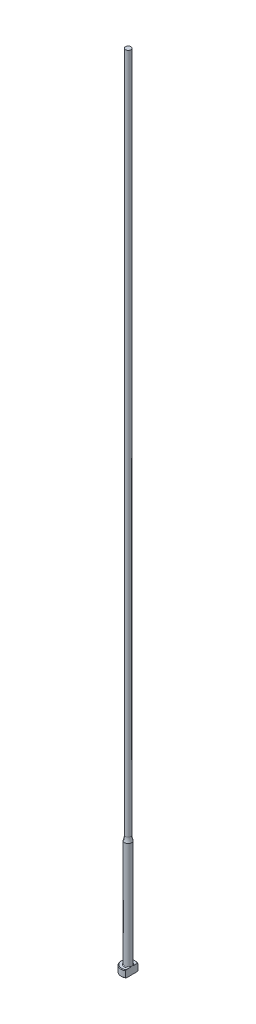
ISO-10303-21;
HEADER;
FILE_DESCRIPTION(('STEP AP214'),'2;1');
FILE_NAME('part.step','',(''),(''),'','','');
FILE_SCHEMA(('AUTOMOTIVE_DESIGN { 1 0 10303 214 1 1 1 1 }'));
ENDSEC;
DATA;
#1=APPLICATION_CONTEXT('core data for automotive mechanical design processes');
#2=APPLICATION_PROTOCOL_DEFINITION('international standard','automotive_design',2000,#1);
#3=PRODUCT_CONTEXT('',#1,'mechanical');
#4=PRODUCT('Part','Part','',(#3));
#5=PRODUCT_RELATED_PRODUCT_CATEGORY('part','',(#4));
#6=PRODUCT_DEFINITION_FORMATION('','',#4);
#7=PRODUCT_DEFINITION_CONTEXT('part definition',#1,'design');
#8=PRODUCT_DEFINITION('design','',#6,#7);
#9=PRODUCT_DEFINITION_SHAPE('','',#8);
#10=(LENGTH_UNIT() NAMED_UNIT(*) SI_UNIT(.MILLI.,.METRE.));
#11=(NAMED_UNIT(*) PLANE_ANGLE_UNIT() SI_UNIT($,.RADIAN.));
#12=(NAMED_UNIT(*) SI_UNIT($,.STERADIAN.) SOLID_ANGLE_UNIT());
#13=UNCERTAINTY_MEASURE_WITH_UNIT(LENGTH_MEASURE(1.E-05),#10,'distance_accuracy_value','');
#14=(GEOMETRIC_REPRESENTATION_CONTEXT(3) GLOBAL_UNCERTAINTY_ASSIGNED_CONTEXT((#13)) GLOBAL_UNIT_ASSIGNED_CONTEXT((#10,
#11,#12)) REPRESENTATION_CONTEXT('',''));
#15=CARTESIAN_POINT('',(0.,0.,0.));
#16=DIRECTION('',(0.,0.,1.));
#17=DIRECTION('',(1.,0.,0.));
#18=AXIS2_PLACEMENT_3D('',#15,#16,#17);
#19=CARTESIAN_POINT('',(-3.17499999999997,3.175,0.));
#20=DIRECTION('',(0.,1.,0.));
#21=DIRECTION('',(0.,0.,1.));
#22=AXIS2_PLACEMENT_3D('',#19,#20,#21);
#23=PLANE('',#22);
#24=CARTESIAN_POINT('',(0.,3.175,0.));
#25=DIRECTION('',(0.,1.,0.));
#26=DIRECTION('',(0.,0.,1.));
#27=AXIS2_PLACEMENT_3D('',#24,#25,#26);
#28=CIRCLE('',#27,2.92099999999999);
#29=CARTESIAN_POINT('',(1.58749999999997,3.175,-2.4519552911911));
#30=VERTEX_POINT('',#29);
#31=CARTESIAN_POINT('',(1.58749999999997,3.175,2.4519552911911));
#32=VERTEX_POINT('',#31);
#33=EDGE_CURVE('E105',#30,#32,#28,.T.);
#34=ORIENTED_EDGE('',*,*,#33,.T.);
#35=DIRECTION('',(0.,0.,1.));
#36=VECTOR('',#35,1.);
#37=CARTESIAN_POINT('',(1.58749999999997,3.17499999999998,2.74963065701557));
#38=LINE('',#37,#36);
#39=CARTESIAN_POINT('',(1.58749999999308,3.175,0.933255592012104));
#40=VERTEX_POINT('',#39);
#41=EDGE_CURVE('E126',#40,#32,#38,.T.);
#42=ORIENTED_EDGE('',*,*,#41,.F.);
#43=CARTESIAN_POINT('',(0.,3.175,0.));
#44=DIRECTION('',(0.,1.,0.));
#45=DIRECTION('',(0.,0.,1.));
#46=AXIS2_PLACEMENT_3D('',#43,#44,#45);
#47=CIRCLE('',#46,1.84149999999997);
#48=CARTESIAN_POINT('',(1.58749999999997,3.17500000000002,-0.933255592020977));
#49=VERTEX_POINT('',#48);
#50=EDGE_CURVE('E11',#40,#49,#47,.F.);
#51=ORIENTED_EDGE('',*,*,#50,.T.);
#52=EDGE_CURVE('E52',#30,#49,#38,.T.);
#53=ORIENTED_EDGE('',*,*,#52,.F.);
#54=EDGE_LOOP('',(#34,#42,#51,#53));
#55=FACE_BOUND('',#54,.T.);
#56=ADVANCED_FACE('F32',(#55),#23,.T.);
#57=CARTESIAN_POINT('',(0.,259.958771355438,0.));
#58=DIRECTION('',(0.,1.,0.));
#59=DIRECTION('',(0.,0.,1.));
#60=AXIS2_PLACEMENT_3D('',#57,#58,#59);
#61=CYLINDRICAL_SURFACE('',#60,3.17499999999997);
#62=CARTESIAN_POINT('',(0.,2.92100000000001,0.));
#63=DIRECTION('',(0.,1.,0.));
#64=DIRECTION('',(0.,0.,1.));
#65=AXIS2_PLACEMENT_3D('',#62,#63,#64);
#66=CIRCLE('',#65,3.17499999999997);
#67=CARTESIAN_POINT('',(1.58749999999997,2.92100000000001,2.74963065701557));
#68=VERTEX_POINT('',#67);
#69=CARTESIAN_POINT('',(1.58749999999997,2.92100000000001,-2.74963065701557));
#70=VERTEX_POINT('',#69);
#71=EDGE_CURVE('E98',#68,#70,#66,.F.);
#72=ORIENTED_EDGE('',*,*,#71,.T.);
#73=DIRECTION('',(0.,-1.,0.));
#74=VECTOR('',#73,1.);
#75=CARTESIAN_POINT('',(1.58749999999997,355.601,-2.74963065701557));
#76=LINE('',#75,#74);
#77=CARTESIAN_POINT('',(1.58749999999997,0.253999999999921,-2.74963065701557));
#78=VERTEX_POINT('',#77);
#79=EDGE_CURVE('E141',#70,#78,#76,.T.);
#80=ORIENTED_EDGE('',*,*,#79,.T.);
#81=CARTESIAN_POINT('',(0.,0.253999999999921,0.));
#82=DIRECTION('',(0.,-1.,0.));
#83=DIRECTION('',(0.,0.,-1.));
#84=AXIS2_PLACEMENT_3D('',#81,#82,#83);
#85=CIRCLE('',#84,3.17499999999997);
#86=CARTESIAN_POINT('',(1.58749999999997,0.253999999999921,2.74963065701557));
#87=VERTEX_POINT('',#86);
#88=EDGE_CURVE('E95',#78,#87,#85,.F.);
#89=ORIENTED_EDGE('',*,*,#88,.T.);
#90=DIRECTION('',(0.,-1.,0.));
#91=VECTOR('',#90,1.);
#92=CARTESIAN_POINT('',(1.58749999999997,355.601,2.74963065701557));
#93=LINE('',#92,#91);
#94=EDGE_CURVE('E88',#68,#87,#93,.T.);
#95=ORIENTED_EDGE('',*,*,#94,.F.);
#96=EDGE_LOOP('',(#72,#80,#89,#95));
#97=FACE_BOUND('',#96,.T.);
#98=ADVANCED_FACE('F191',(#97),#61,.T.);
#99=CARTESIAN_POINT('',(0.,0.,0.));
#100=DIRECTION('',(0.,-1.,0.));
#101=DIRECTION('',(0.,0.,-1.));
#102=AXIS2_PLACEMENT_3D('',#99,#100,#101);
#103=PLANE('',#102);
#104=CARTESIAN_POINT('',(0.,0.,0.));
#105=DIRECTION('',(0.,-1.,0.));
#106=DIRECTION('',(0.,0.,-1.));
#107=AXIS2_PLACEMENT_3D('',#104,#105,#106);
#108=CIRCLE('',#107,2.92100000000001);
#109=CARTESIAN_POINT('',(1.58749999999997,0.,2.45195529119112));
#110=VERTEX_POINT('',#109);
#111=CARTESIAN_POINT('',(1.58749999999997,0.,-2.45195529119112));
#112=VERTEX_POINT('',#111);
#113=EDGE_CURVE('E93',#110,#112,#108,.T.);
#114=ORIENTED_EDGE('',*,*,#113,.T.);
#115=DIRECTION('',(0.,0.,1.));
#116=VECTOR('',#115,1.);
#117=CARTESIAN_POINT('',(1.58749999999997,0.,2.74963065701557));
#118=LINE('',#117,#116);
#119=EDGE_CURVE('E78',#112,#110,#118,.T.);
#120=ORIENTED_EDGE('',*,*,#119,.T.);
#121=EDGE_LOOP('',(#114,#120));
#122=FACE_BOUND('',#121,.T.);
#123=ADVANCED_FACE('F97',(#122),#103,.T.);
#124=CARTESIAN_POINT('',(0.,3.17499999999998,0.));
#125=DIRECTION('',(0.,-1.,0.));
#126=DIRECTION('',(0.,0.,-1.));
#127=AXIS2_PLACEMENT_3D('',#124,#125,#126);
#128=CONICAL_SURFACE('',#127,2.92100000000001,0.785398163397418);
#129=ORIENTED_EDGE('',*,*,#71,.F.);
#130=CARTESIAN_POINT('',(1.58749999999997,-0.161620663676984,-6.0529050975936));
#131=CARTESIAN_POINT('',(1.58749999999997,-0.0288893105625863,-5.91567682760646));
#132=CARTESIAN_POINT('',(1.58749999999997,0.103699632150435,-5.77831035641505));
#133=CARTESIAN_POINT('',(1.58749999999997,0.368508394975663,-5.50321874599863));
#134=CARTESIAN_POINT('',(1.58749999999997,0.5007282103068,-5.3654936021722));
#135=CARTESIAN_POINT('',(1.58749999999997,0.764778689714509,-5.08953516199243));
#136=CARTESIAN_POINT('',(1.58749999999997,0.896609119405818,-4.95130164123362));
#137=CARTESIAN_POINT('',(1.58749999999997,1.15968706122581,-4.67428233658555));
#138=CARTESIAN_POINT('',(1.58749999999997,1.29093457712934,-4.5354965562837));
#139=CARTESIAN_POINT('',(1.58749999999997,1.55007705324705,-4.25997724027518));
#140=CARTESIAN_POINT('',(1.58749999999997,1.67798684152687,-4.12325766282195));
#141=CARTESIAN_POINT('',(1.58749999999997,1.9328486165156,-3.84892898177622));
#142=CARTESIAN_POINT('',(1.58749999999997,2.05980060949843,-3.71131988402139));
#143=CARTESIAN_POINT('',(1.58749999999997,2.31237508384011,-3.43493978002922));
#144=CARTESIAN_POINT('',(1.58749999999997,2.43799784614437,-3.29616903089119));
#145=CARTESIAN_POINT('',(1.58749999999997,2.68741369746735,-3.01699558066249));
#146=CARTESIAN_POINT('',(1.58749999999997,2.81120686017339,-2.8765929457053));
#147=CARTESIAN_POINT('',(1.58749999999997,3.00875865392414,-2.64816703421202));
#148=CARTESIAN_POINT('',(1.58749999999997,3.08336151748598,-2.56087478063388));
#149=CARTESIAN_POINT('',(1.58749999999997,3.23123871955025,-2.385154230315));
#150=CARTESIAN_POINT('',(1.58749999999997,3.30451292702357,-2.29672582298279));
#151=CARTESIAN_POINT('',(1.58749999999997,3.45004422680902,-2.11747400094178));
#152=CARTESIAN_POINT('',(1.58749999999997,3.52228237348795,-2.02663514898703));
#153=CARTESIAN_POINT('',(1.58749999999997,3.66423097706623,-1.84302524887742));
#154=CARTESIAN_POINT('',(1.58749999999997,3.73394203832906,-1.75025467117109));
#155=CARTESIAN_POINT('',(1.58749999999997,3.87080633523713,-1.56067475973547));
#156=CARTESIAN_POINT('',(1.58749999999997,3.93790459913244,-1.46382547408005));
#157=CARTESIAN_POINT('',(1.58749999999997,4.06669147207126,-1.26632594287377));
#158=CARTESIAN_POINT('',(1.58749999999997,4.12837264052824,-1.16567073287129));
#159=CARTESIAN_POINT('',(1.58749999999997,4.21402252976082,-1.01165766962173));
#160=CARTESIAN_POINT('',(1.58749999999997,4.2412792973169,-0.960142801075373));
#161=CARTESIAN_POINT('',(1.58749999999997,4.29309798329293,-0.85578092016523));
#162=CARTESIAN_POINT('',(1.58749999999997,4.3176594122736,-0.802933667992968));
#163=CARTESIAN_POINT('',(1.58749999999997,4.38614656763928,-0.642461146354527));
#164=CARTESIAN_POINT('',(1.58749999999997,4.42510149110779,-0.532518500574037));
#165=CARTESIAN_POINT('',(1.58749999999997,4.46726244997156,-0.367680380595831));
#166=CARTESIAN_POINT('',(1.58749999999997,4.47844427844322,-0.314802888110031));
#167=CARTESIAN_POINT('',(1.58749999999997,4.49576654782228,-0.208209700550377));
#168=CARTESIAN_POINT('',(1.58749999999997,4.50190743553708,-0.154494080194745));
#169=CARTESIAN_POINT('',(1.58749999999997,4.50871296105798,-0.0468792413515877));
#170=CARTESIAN_POINT('',(1.58749999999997,4.50939451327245,0.00701889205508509));
#171=CARTESIAN_POINT('',(1.58749999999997,4.5052767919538,0.114606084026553));
#172=CARTESIAN_POINT('',(1.58749999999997,4.5004770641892,0.16829512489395));
#173=CARTESIAN_POINT('',(1.58749999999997,4.48579689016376,0.274485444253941));
#174=CARTESIAN_POINT('',(1.58749999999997,4.47596081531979,0.326992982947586));
#175=CARTESIAN_POINT('',(1.58749999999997,4.4518180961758,0.430974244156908));
#176=CARTESIAN_POINT('',(1.58749999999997,4.43750969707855,0.482447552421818));
#177=CARTESIAN_POINT('',(1.58749999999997,4.40502489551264,0.58446088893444));
#178=CARTESIAN_POINT('',(1.58749999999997,4.38682724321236,0.634994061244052));
#179=CARTESIAN_POINT('',(1.58749999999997,4.34729308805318,0.734789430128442));
#180=CARTESIAN_POINT('',(1.58749999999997,4.32595722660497,0.784051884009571));
#181=CARTESIAN_POINT('',(1.58749999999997,4.25791922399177,0.93054934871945));
#182=CARTESIAN_POINT('',(1.58749999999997,4.20736047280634,1.02598802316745));
#183=CARTESIAN_POINT('',(1.58749999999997,4.09955451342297,1.21304313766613));
#184=CARTESIAN_POINT('',(1.58749999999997,4.04229912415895,1.30465471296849));
#185=CARTESIAN_POINT('',(1.58749999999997,3.92308746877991,1.48526211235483));
#186=CARTESIAN_POINT('',(1.58749999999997,3.86111349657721,1.57424615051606));
#187=CARTESIAN_POINT('',(1.58749999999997,3.73408621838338,1.74990003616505));
#188=CARTESIAN_POINT('',(1.58749999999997,3.66903444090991,1.83657099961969));
#189=CARTESIAN_POINT('',(1.58749999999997,3.53583371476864,2.009317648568));
#190=CARTESIAN_POINT('',(1.58749999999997,3.46765527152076,2.09537048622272));
#191=CARTESIAN_POINT('',(1.58749999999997,3.32960643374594,2.26611736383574));
#192=CARTESIAN_POINT('',(1.58749999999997,3.25973586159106,2.35081125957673));
#193=CARTESIAN_POINT('',(1.58749999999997,3.04858139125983,2.60290121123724));
#194=CARTESIAN_POINT('',(1.58749999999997,2.90542388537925,2.7687253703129));
#195=CARTESIAN_POINT('',(1.58749999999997,2.64069522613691,3.06970913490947));
#196=CARTESIAN_POINT('',(1.58749999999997,2.5195945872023,3.20528660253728));
#197=CARTESIAN_POINT('',(1.58749999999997,2.27590400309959,3.47510321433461));
#198=CARTESIAN_POINT('',(1.58749999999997,2.1533140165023,3.60934232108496));
#199=CARTESIAN_POINT('',(1.58749999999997,1.9069423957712,3.87695374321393));
#200=CARTESIAN_POINT('',(1.58749999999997,1.78315974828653,4.01032512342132));
#201=CARTESIAN_POINT('',(1.58749999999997,1.53478104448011,4.2763088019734));
#202=CARTESIAN_POINT('',(1.58749999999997,1.41018498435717,4.40892109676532));
#203=CARTESIAN_POINT('',(1.58749999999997,1.04574684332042,4.79499418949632));
#204=CARTESIAN_POINT('',(1.58749999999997,0.805076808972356,5.04767313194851));
#205=CARTESIAN_POINT('',(1.58749999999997,0.44312150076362,5.42550911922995));
#206=CARTESIAN_POINT('',(1.58749999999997,0.322378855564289,5.55118772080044));
#207=CARTESIAN_POINT('',(1.58749999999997,0.0805914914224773,5.8022520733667));
#208=CARTESIAN_POINT('',(1.58749999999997,-0.0404532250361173,5.92763782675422));
#209=CARTESIAN_POINT('',(1.58749999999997,-0.161620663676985,6.0529050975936));
#210=B_SPLINE_CURVE_WITH_KNOTS('',3,(#130,#131,#132,#133,#134,#135,#136,#137,#138,#139,#140,
#141,#142,#143,#144,#145,#146,#147,#148,#149,#150,#151,#152,#153,#154,#155,#156,#157,#158,#159,
#160,#161,#162,#163,#164,#165,#166,#167,#168,#169,#170,#171,#172,#173,#174,#175,#176,#177,#178,
#179,#180,#181,#182,#183,#184,#185,#186,#187,#188,#189,#190,#191,#192,#193,#194,#195,#196,#197,
#198,#199,#200,#201,#202,#203,#204,#205,#206,#207,#208,#209),.UNSPECIFIED.,.F.,.F.,(4,2,2,2,2,2,
2,2,2,2,2,2,2,2,2,2,2,2,2,2,2,2,2,2,2,2,2,2,2,2,2,2,2,2,2,2,2,2,2,4),(0.,0.572750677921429,
1.14550874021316,1.71856057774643,2.29160869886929,2.85328006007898,3.41494773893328,
3.97649423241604,4.53801804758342,4.88249307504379,5.2270018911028,5.57515326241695,
5.92322081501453,6.27657800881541,6.63041319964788,6.80518126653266,6.97998101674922,
7.32824262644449,7.49018491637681,7.65211285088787,7.81353889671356,7.97497832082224,
8.13501929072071,8.29512313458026,8.45612518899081,8.61709438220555,8.94062993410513,
9.26456495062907,9.58978187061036,9.91483894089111,10.2441741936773,10.5735441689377,
11.2306812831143,11.7760337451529,12.3214014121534,12.8672825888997,13.4131663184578,
14.4600164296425,14.9828595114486,15.505698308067),.UNSPECIFIED.);
#211=EDGE_CURVE('E118',#32,#68,#210,.T.);
#212=ORIENTED_EDGE('',*,*,#211,.F.);
#213=ORIENTED_EDGE('',*,*,#33,.F.);
#214=EDGE_CURVE('E117',#70,#30,#210,.T.);
#215=ORIENTED_EDGE('',*,*,#214,.F.);
#216=EDGE_LOOP('',(#129,#212,#213,#215));
#217=FACE_BOUND('',#216,.T.);
#218=ADVANCED_FACE('F162',(#217),#128,.T.);
#219=CARTESIAN_POINT('',(0.,0.253999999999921,0.));
#220=DIRECTION('',(0.,1.,0.));
#221=DIRECTION('',(0.,0.,1.));
#222=AXIS2_PLACEMENT_3D('',#219,#220,#221);
#223=CONICAL_SURFACE('',#222,3.17499999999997,0.785398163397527);
#224=ORIENTED_EDGE('',*,*,#88,.F.);
#225=CARTESIAN_POINT('',(1.58749999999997,3.33662066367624,6.0529050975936));
#226=CARTESIAN_POINT('',(1.58749999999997,3.20388931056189,5.91567682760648));
#227=CARTESIAN_POINT('',(1.58749999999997,3.07130036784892,5.7783103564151));
#228=CARTESIAN_POINT('',(1.58749999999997,2.80649160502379,5.50321874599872));
#229=CARTESIAN_POINT('',(1.58749999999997,2.6742717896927,5.36549360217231));
#230=CARTESIAN_POINT('',(1.58749999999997,2.41022131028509,5.08953516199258));
#231=CARTESIAN_POINT('',(1.58749999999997,2.27839088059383,4.95130164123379));
#232=CARTESIAN_POINT('',(1.58749999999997,2.01531293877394,4.67428233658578));
#233=CARTESIAN_POINT('',(1.58749999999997,1.88406542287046,4.53549655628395));
#234=CARTESIAN_POINT('',(1.58749999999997,1.62492294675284,4.25997724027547));
#235=CARTESIAN_POINT('',(1.58749999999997,1.49701315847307,4.12325766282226));
#236=CARTESIAN_POINT('',(1.58749999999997,1.24215138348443,3.84892898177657));
#237=CARTESIAN_POINT('',(1.58749999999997,1.11519939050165,3.71131988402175));
#238=CARTESIAN_POINT('',(1.58749999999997,0.862624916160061,3.43493978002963));
#239=CARTESIAN_POINT('',(1.58749999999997,0.737002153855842,3.29616903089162));
#240=CARTESIAN_POINT('',(1.58749999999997,0.487586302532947,3.01699558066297));
#241=CARTESIAN_POINT('',(1.58749999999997,0.363793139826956,2.8765929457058));
#242=CARTESIAN_POINT('',(1.58749999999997,0.166241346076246,2.64816703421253));
#243=CARTESIAN_POINT('',(1.58749999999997,0.0916384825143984,2.56087478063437));
#244=CARTESIAN_POINT('',(1.58749999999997,-0.0562387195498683,2.38515423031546));
#245=CARTESIAN_POINT('',(1.58749999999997,-0.129512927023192,2.29672582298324));
#246=CARTESIAN_POINT('',(1.58749999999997,-0.275044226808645,2.1174740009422));
#247=CARTESIAN_POINT('',(1.58749999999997,-0.347282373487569,2.02663514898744));
#248=CARTESIAN_POINT('',(1.58749999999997,-0.489230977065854,1.8430252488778));
#249=CARTESIAN_POINT('',(1.58749999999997,-0.558942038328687,1.75025467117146));
#250=CARTESIAN_POINT('',(1.58749999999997,-0.695806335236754,1.5606747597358));
#251=CARTESIAN_POINT('',(1.58749999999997,-0.762904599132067,1.46382547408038));
#252=CARTESIAN_POINT('',(1.58749999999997,-0.89169147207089,1.26632594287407));
#253=CARTESIAN_POINT('',(1.58749999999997,-0.953372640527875,1.16567073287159));
#254=CARTESIAN_POINT('',(1.58749999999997,-1.03902252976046,1.01165766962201));
#255=CARTESIAN_POINT('',(1.58749999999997,-1.06627929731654,0.960142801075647));
#256=CARTESIAN_POINT('',(1.58749999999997,-1.11809798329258,0.855780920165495));
#257=CARTESIAN_POINT('',(1.58749999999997,-1.14265941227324,0.802933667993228));
#258=CARTESIAN_POINT('',(1.58749999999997,-1.21114656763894,0.642461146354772));
#259=CARTESIAN_POINT('',(1.58749999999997,-1.25010149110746,0.532518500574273));
#260=CARTESIAN_POINT('',(1.58749999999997,-1.29226244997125,0.367680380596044));
#261=CARTESIAN_POINT('',(1.58749999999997,-1.30344427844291,0.314802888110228));
#262=CARTESIAN_POINT('',(1.58749999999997,-1.32076654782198,0.208209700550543));
#263=CARTESIAN_POINT('',(1.58749999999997,-1.32690743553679,0.154494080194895));
#264=CARTESIAN_POINT('',(1.58749999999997,-1.3337129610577,0.0468792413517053));
#265=CARTESIAN_POINT('',(1.58749999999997,-1.33439451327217,-0.00701889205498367));
#266=CARTESIAN_POINT('',(1.58749999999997,-1.33027679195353,-0.114606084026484));
#267=CARTESIAN_POINT('',(1.58749999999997,-1.32547706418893,-0.168295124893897));
#268=CARTESIAN_POINT('',(1.58749999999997,-1.31079689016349,-0.274485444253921));
#269=CARTESIAN_POINT('',(1.58749999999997,-1.30096081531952,-0.326992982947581));
#270=CARTESIAN_POINT('',(1.58749999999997,-1.27681809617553,-0.430974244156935));
#271=CARTESIAN_POINT('',(1.58749999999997,-1.26250969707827,-0.48244755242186));
#272=CARTESIAN_POINT('',(1.58749999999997,-1.23002489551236,-0.584460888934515));
#273=CARTESIAN_POINT('',(1.58749999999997,-1.21182724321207,-0.634994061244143));
#274=CARTESIAN_POINT('',(1.58749999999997,-1.17229308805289,-0.734789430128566));
#275=CARTESIAN_POINT('',(1.58749999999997,-1.15095722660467,-0.784051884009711));
#276=CARTESIAN_POINT('',(1.58749999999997,-1.08291922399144,-0.930549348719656));
#277=CARTESIAN_POINT('',(1.58749999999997,-1.03236047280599,-1.0259880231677));
#278=CARTESIAN_POINT('',(1.58749999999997,-0.924554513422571,-1.21304313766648));
#279=CARTESIAN_POINT('',(1.58749999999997,-0.867299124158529,-1.30465471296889));
#280=CARTESIAN_POINT('',(1.58749999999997,-0.748087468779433,-1.48526211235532));
#281=CARTESIAN_POINT('',(1.58749999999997,-0.686113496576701,-1.5742461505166));
#282=CARTESIAN_POINT('',(1.58749999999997,-0.559086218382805,-1.74990003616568));
#283=CARTESIAN_POINT('',(1.58749999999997,-0.494034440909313,-1.83657099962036));
#284=CARTESIAN_POINT('',(1.58749999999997,-0.360833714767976,-2.00931764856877));
#285=CARTESIAN_POINT('',(1.58749999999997,-0.292655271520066,-2.09537048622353));
#286=CARTESIAN_POINT('',(1.58749999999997,-0.154606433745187,-2.26611736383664));
#287=CARTESIAN_POINT('',(1.58749999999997,-0.0847358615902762,-2.35081125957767));
#288=CARTESIAN_POINT('',(1.58749999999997,0.126418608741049,-2.60290121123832));
#289=CARTESIAN_POINT('',(1.58749999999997,0.269576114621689,-2.76872537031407));
#290=CARTESIAN_POINT('',(1.58749999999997,0.534304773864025,-3.06970913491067));
#291=CARTESIAN_POINT('',(1.58749999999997,0.655405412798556,-3.20528660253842));
#292=CARTESIAN_POINT('',(1.58749999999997,0.899095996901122,-3.47510321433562));
#293=CARTESIAN_POINT('',(1.58749999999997,1.02168598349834,-3.60934232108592));
#294=CARTESIAN_POINT('',(1.58749999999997,1.26805760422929,-3.87695374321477));
#295=CARTESIAN_POINT('',(1.58749999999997,1.39184025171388,-4.0103251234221));
#296=CARTESIAN_POINT('',(1.58749999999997,1.64021895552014,-4.27630880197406));
#297=CARTESIAN_POINT('',(1.58749999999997,1.76481501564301,-4.40892109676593));
#298=CARTESIAN_POINT('',(1.58749999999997,2.12925315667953,-4.79499418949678));
#299=CARTESIAN_POINT('',(1.58749999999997,2.36992319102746,-5.04767313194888));
#300=CARTESIAN_POINT('',(1.58749999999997,2.73187849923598,-5.42550911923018));
#301=CARTESIAN_POINT('',(1.58749999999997,2.85262114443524,-5.55118772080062));
#302=CARTESIAN_POINT('',(1.58749999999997,3.09440850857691,-5.80225207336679));
#303=CARTESIAN_POINT('',(1.58749999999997,3.21545322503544,-5.92763782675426));
#304=CARTESIAN_POINT('',(1.58749999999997,3.33662066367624,-6.0529050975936));
#305=B_SPLINE_CURVE_WITH_KNOTS('',3,(#225,#226,#227,#228,#229,#230,#231,#232,#233,#234,#235,
#236,#237,#238,#239,#240,#241,#242,#243,#244,#245,#246,#247,#248,#249,#250,#251,#252,#253,#254,
#255,#256,#257,#258,#259,#260,#261,#262,#263,#264,#265,#266,#267,#268,#269,#270,#271,#272,#273,
#274,#275,#276,#277,#278,#279,#280,#281,#282,#283,#284,#285,#286,#287,#288,#289,#290,#291,#292,
#293,#294,#295,#296,#297,#298,#299,#300,#301,#302,#303,#304),.UNSPECIFIED.,.F.,.F.,(4,2,2,2,2,2,
2,2,2,2,2,2,2,2,2,2,2,2,2,2,2,2,2,2,2,2,2,2,2,2,2,2,2,2,2,2,2,2,2,4),(0.,0.572750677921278,
1.14550874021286,1.71856057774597,2.29160869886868,2.85328006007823,3.4149477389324,
3.97649423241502,4.53801804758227,4.88249307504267,5.22700189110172,5.5751532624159,
5.92322081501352,6.27657800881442,6.63041319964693,6.80518126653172,6.9799810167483,
7.3282426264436,7.49018491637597,7.65211285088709,7.81353889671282,7.97497832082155,
8.13501929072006,8.29512313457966,8.45612518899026,8.61709438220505,8.9406299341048,
9.2645649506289,9.58978187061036,9.91483894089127,10.2441741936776,10.5735441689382,
11.2306812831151,11.7760337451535,12.3214014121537,12.8672825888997,13.4131663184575,
14.4600164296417,14.9828595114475,15.5056983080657),.UNSPECIFIED.);
#306=EDGE_CURVE('E81',#112,#78,#305,.T.);
#307=ORIENTED_EDGE('',*,*,#306,.F.);
#308=ORIENTED_EDGE('',*,*,#113,.F.);
#309=EDGE_CURVE('E84',#87,#110,#305,.T.);
#310=ORIENTED_EDGE('',*,*,#309,.F.);
#311=EDGE_LOOP('',(#224,#307,#308,#310));
#312=FACE_BOUND('',#311,.T.);
#313=ADVANCED_FACE('F92',(#312),#223,.T.);
#314=CARTESIAN_POINT('',(0.,3.42900000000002,0.));
#315=DIRECTION('',(0.,1.,0.));
#316=DIRECTION('',(0.,0.,1.));
#317=AXIS2_PLACEMENT_3D('',#314,#315,#316);
#318=TOROIDAL_SURFACE('',#317,1.84149999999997,0.254);
#319=CARTESIAN_POINT('',(1.58749999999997,3.42900000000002,0.));
#320=CARTESIAN_POINT('',(1.58749999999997,3.42899942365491,-1.9220514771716E-10));
#321=CARTESIAN_POINT('',(1.58749999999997,3.42899884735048,-1.2261161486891E-07));
#322=CARTESIAN_POINT('',(1.58749999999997,3.42899773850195,-5.09676365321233E-07));
#323=CARTESIAN_POINT('',(1.58749999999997,3.42899720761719,-7.78176328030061E-07));
#324=CARTESIAN_POINT('',(1.58749999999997,3.42899614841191,-1.42307272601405E-06));
#325=CARTESIAN_POINT('',(1.58749999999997,3.42899562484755,-1.80713867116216E-06));
#326=CARTESIAN_POINT('',(1.58749999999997,3.42899463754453,-2.63494846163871E-06));
#327=CARTESIAN_POINT('',(1.58749999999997,3.42899417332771,-3.07814756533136E-06));
#328=CARTESIAN_POINT('',(1.58749999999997,3.42899261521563,-4.66897357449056E-06));
#329=CARTESIAN_POINT('',(1.58749999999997,3.42899159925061,-5.89404908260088E-06));
#330=CARTESIAN_POINT('',(1.58749999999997,3.42898979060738,-8.42427511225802E-06));
#331=CARTESIAN_POINT('',(1.58749999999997,3.42898899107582,-9.7248057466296E-06));
#332=CARTESIAN_POINT('',(1.58749999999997,3.42898598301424,-1.48060601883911E-05));
#333=CARTESIAN_POINT('',(1.58749999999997,3.42898393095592,-1.86838281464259E-05));
#334=CARTESIAN_POINT('',(1.58749999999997,3.42898057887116,-2.63261117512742E-05));
#335=CARTESIAN_POINT('',(1.58749999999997,3.42897922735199,-3.00687417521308E-05));
#336=CARTESIAN_POINT('',(1.58749999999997,3.42897347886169,-4.60276298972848E-05));
#337=CARTESIAN_POINT('',(1.58749999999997,3.42896911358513,-5.8247019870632E-05));
#338=CARTESIAN_POINT('',(1.58749999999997,3.42896211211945,-8.11070097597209E-05));
#339=CARTESIAN_POINT('',(1.58749999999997,3.42895931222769,-9.16953114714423E-05));
#340=CARTESIAN_POINT('',(1.58749999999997,3.42893712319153,-0.000168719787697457));
#341=CARTESIAN_POINT('',(1.58749999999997,3.42890881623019,-0.000232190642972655));
#342=CARTESIAN_POINT('',(1.58749999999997,3.42880276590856,-0.000479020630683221));
#343=CARTESIAN_POINT('',(1.58749999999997,3.42873165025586,-0.00066443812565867));
#344=CARTESIAN_POINT('',(1.58749999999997,3.42845137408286,-0.0013844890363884));
#345=CARTESIAN_POINT('',(1.58749999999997,3.42823526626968,-0.00191701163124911));
#346=CARTESIAN_POINT('',(1.58749999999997,3.42735449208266,-0.00409774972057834));
#347=CARTESIAN_POINT('',(1.58749999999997,3.42669768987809,-0.00574830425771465));
#348=CARTESIAN_POINT('',(1.58749999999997,3.4174405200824,-0.0289985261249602));
#349=CARTESIAN_POINT('',(1.58749999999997,3.40878325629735,-0.0505816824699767));
#350=CARTESIAN_POINT('',(1.58749999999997,3.39189297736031,-0.0929947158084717));
#351=CARTESIAN_POINT('',(1.58749999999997,3.38365605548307,-0.11382315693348));
#352=CARTESIAN_POINT('',(1.58749999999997,3.36635393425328,-0.157956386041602));
#353=CARTESIAN_POINT('',(1.58749999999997,3.35730391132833,-0.181267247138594));
#354=CARTESIAN_POINT('',(1.58749999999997,3.33936775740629,-0.228222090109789));
#355=CARTESIAN_POINT('',(1.58749999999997,3.33048420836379,-0.25186705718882));
#356=CARTESIAN_POINT('',(1.58749999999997,3.30894496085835,-0.310512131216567));
#357=CARTESIAN_POINT('',(1.58749999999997,3.29649449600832,-0.345588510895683));
#358=CARTESIAN_POINT('',(1.58749999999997,3.27296975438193,-0.415278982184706));
#359=CARTESIAN_POINT('',(1.58749999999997,3.26186987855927,-0.449884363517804));
#360=CARTESIAN_POINT('',(1.58749999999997,3.2395832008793,-0.524471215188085));
#361=CARTESIAN_POINT('',(1.58749999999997,3.22860862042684,-0.564517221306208));
#362=CARTESIAN_POINT('',(1.58749999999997,3.20902534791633,-0.645529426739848));
#363=CARTESIAN_POINT('',(1.58749999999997,3.20043582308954,-0.686500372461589));
#364=CARTESIAN_POINT('',(1.58749999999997,3.18611712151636,-0.771546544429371));
#365=CARTESIAN_POINT('',(1.58749999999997,3.18059550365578,-0.815658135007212));
#366=CARTESIAN_POINT('',(1.58749999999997,3.17455396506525,-0.904117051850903));
#367=CARTESIAN_POINT('',(1.58749999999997,3.17401361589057,-0.948462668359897));
#368=CARTESIAN_POINT('',(1.58749999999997,3.17898948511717,-1.02531896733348));
#369=CARTESIAN_POINT('',(1.58749999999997,3.1829739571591,-1.05792141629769));
#370=CARTESIAN_POINT('',(1.58749999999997,3.19569167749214,-1.12184393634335));
#371=CARTESIAN_POINT('',(1.58749999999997,3.20436049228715,-1.1531753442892));
#372=CARTESIAN_POINT('',(1.58749999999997,3.22236152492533,-1.19946468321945));
#373=CARTESIAN_POINT('',(1.58749999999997,3.2295150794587,-1.21526783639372));
#374=CARTESIAN_POINT('',(1.58749999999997,3.24587062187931,-1.24583726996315));
#375=CARTESIAN_POINT('',(1.58749999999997,3.25507530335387,-1.26060215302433));
#376=CARTESIAN_POINT('',(1.58749999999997,3.27378481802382,-1.28575815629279));
#377=CARTESIAN_POINT('',(1.58749999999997,3.28289001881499,-1.29644383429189));
#378=CARTESIAN_POINT('',(1.58749999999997,3.30268460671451,-1.31623154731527));
#379=CARTESIAN_POINT('',(1.58749999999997,3.31337067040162,-1.32533681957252));
#380=CARTESIAN_POINT('',(1.58749999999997,3.33349977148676,-1.33941140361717));
#381=CARTESIAN_POINT('',(1.58749999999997,3.34261446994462,-1.34484814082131));
#382=CARTESIAN_POINT('',(1.58749999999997,3.36161455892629,-1.35416329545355));
#383=CARTESIAN_POINT('',(1.58749999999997,3.37149946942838,-1.35804267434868));
#384=CARTESIAN_POINT('',(1.58749999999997,3.39188678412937,-1.36398436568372));
#385=CARTESIAN_POINT('',(1.58749999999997,3.40239309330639,-1.36603350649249));
#386=CARTESIAN_POINT('',(1.58749999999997,3.42360372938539,-1.3680840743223));
#387=CARTESIAN_POINT('',(1.58749999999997,3.43430795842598,-1.36808648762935));
#388=CARTESIAN_POINT('',(1.58749999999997,3.45433283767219,-1.36616208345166));
#389=CARTESIAN_POINT('',(1.58749999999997,3.46367506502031,-1.36444960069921));
#390=CARTESIAN_POINT('',(1.58749999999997,3.48195519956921,-1.35953338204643));
#391=CARTESIAN_POINT('',(1.58749999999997,3.49089304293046,-1.3563294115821));
#392=CARTESIAN_POINT('',(1.58749999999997,3.50850302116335,-1.34848006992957));
#393=CARTESIAN_POINT('',(1.58749999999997,3.5171531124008,-1.34378578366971));
#394=CARTESIAN_POINT('',(1.58749999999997,3.53371257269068,-1.33324445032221));
#395=CARTESIAN_POINT('',(1.58749999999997,3.54162163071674,-1.32739692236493));
#396=CARTESIAN_POINT('',(1.58749999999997,3.56107121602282,-1.31107304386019));
#397=CARTESIAN_POINT('',(1.58749999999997,3.57202221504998,-1.29989286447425));
#398=CARTESIAN_POINT('',(1.58749999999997,3.59202509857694,-1.27593566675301));
#399=CARTESIAN_POINT('',(1.58749999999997,3.60107086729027,-1.26315370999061));
#400=CARTESIAN_POINT('',(1.58749999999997,3.62186023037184,-1.22930733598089));
#401=CARTESIAN_POINT('',(1.58749999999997,3.63240584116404,-1.20751096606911));
#402=CARTESIAN_POINT('',(1.58749999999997,3.65004643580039,-1.16266144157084));
#403=CARTESIAN_POINT('',(1.58749999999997,3.65714435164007,-1.13960937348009));
#404=CARTESIAN_POINT('',(1.58749999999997,3.67265428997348,-1.07603916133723));
#405=CARTESIAN_POINT('',(1.58749999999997,3.67834921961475,-1.03486686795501));
#406=CARTESIAN_POINT('',(1.58749999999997,3.68382880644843,-0.951558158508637));
#407=CARTESIAN_POINT('',(1.58749999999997,3.68350976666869,-0.909417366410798));
#408=CARTESIAN_POINT('',(1.58749999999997,3.67745397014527,-0.811383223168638));
#409=CARTESIAN_POINT('',(1.58749999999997,3.66993873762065,-0.755610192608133));
#410=CARTESIAN_POINT('',(1.58749999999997,3.64933373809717,-0.644937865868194));
#411=CARTESIAN_POINT('',(1.58749999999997,3.63621897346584,-0.59004364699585));
#412=CARTESIAN_POINT('',(1.58749999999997,3.60740922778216,-0.485757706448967));
#413=CARTESIAN_POINT('',(1.58749999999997,3.59201096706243,-0.436281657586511));
#414=CARTESIAN_POINT('',(1.58749999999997,3.55922497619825,-0.338551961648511));
#415=CARTESIAN_POINT('',(1.58749999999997,3.5418584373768,-0.290291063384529));
#416=CARTESIAN_POINT('',(1.58749999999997,3.51760237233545,-0.225557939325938));
#417=CARTESIAN_POINT('',(1.58749999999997,3.51126413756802,-0.208874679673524));
#418=CARTESIAN_POINT('',(1.58749999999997,3.49830042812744,-0.17512392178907));
#419=CARTESIAN_POINT('',(1.58749999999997,3.49167176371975,-0.158057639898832));
#420=CARTESIAN_POINT('',(1.58749999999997,3.47585523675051,-0.117638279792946));
#421=CARTESIAN_POINT('',(1.58749999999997,3.46662970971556,-0.0943002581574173));
#422=CARTESIAN_POINT('',(1.58749999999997,3.44889695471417,-0.0497824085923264));
#423=CARTESIAN_POINT('',(1.58749999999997,3.44040039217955,-0.028598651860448));
#424=CARTESIAN_POINT('',(1.58749999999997,3.43130364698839,-0.00575168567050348));
#425=CARTESIAN_POINT('',(1.58749999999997,3.43064818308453,-0.00410451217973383));
#426=CARTESIAN_POINT('',(1.58749999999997,3.42976776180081,-0.00192459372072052));
#427=CARTESIAN_POINT('',(1.58749999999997,3.42955062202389,-0.00138952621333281));
#428=CARTESIAN_POINT('',(1.58749999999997,3.42926908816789,-0.000666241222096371));
#429=CARTESIAN_POINT('',(1.58749999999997,3.42919771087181,-0.000480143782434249));
#430=CARTESIAN_POINT('',(1.58749999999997,3.42909131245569,-0.000232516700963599));
#431=CARTESIAN_POINT('',(1.58749999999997,3.42906294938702,-0.000168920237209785));
#432=CARTESIAN_POINT('',(1.58749999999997,3.42904072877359,-9.17527162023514E-05));
#433=CARTESIAN_POINT('',(1.58749999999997,3.42903792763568,-8.11550293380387E-05));
#434=CARTESIAN_POINT('',(1.58749999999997,3.42903091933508,-5.82743948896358E-05));
#435=CARTESIAN_POINT('',(1.58749999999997,3.42902654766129,-4.60440001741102E-05));
#436=CARTESIAN_POINT('',(1.58749999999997,3.42902079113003,-3.00727682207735E-05));
#437=CARTESIAN_POINT('',(1.58749999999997,3.42901943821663,-2.63286807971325E-05));
#438=CARTESIAN_POINT('',(1.58749999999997,3.42901608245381,-1.86836529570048E-05));
#439=CARTESIAN_POINT('',(1.58749999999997,3.4290140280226,-1.48046517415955E-05));
#440=CARTESIAN_POINT('',(1.58749999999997,3.42901101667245,-9.72223943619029E-06));
#441=CARTESIAN_POINT('',(1.58749999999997,3.42901021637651,-8.42159649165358E-06));
#442=CARTESIAN_POINT('',(1.58749999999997,3.42900840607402,-5.89129729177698E-06));
#443=CARTESIAN_POINT('',(1.58749999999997,3.42900738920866,-4.66626867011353E-06));
#444=CARTESIAN_POINT('',(1.58749999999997,3.42900582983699,-3.07568803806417E-06));
#445=CARTESIAN_POINT('',(1.58749999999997,3.42900536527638,-2.63259565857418E-06));
#446=CARTESIAN_POINT('',(1.58749999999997,3.4290043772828,-1.80506085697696E-06));
#447=CARTESIAN_POINT('',(1.58749999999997,3.42900385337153,-1.42116387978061E-06));
#448=CARTESIAN_POINT('',(1.58749999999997,3.42900279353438,-7.76675643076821E-07));
#449=CARTESIAN_POINT('',(1.58749999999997,3.42900226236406,-5.08406487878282E-07));
#450=CARTESIAN_POINT('',(1.58749999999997,3.42900115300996,-1.21901887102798E-07));
#451=CARTESIAN_POINT('',(1.58749999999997,3.42900057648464,1.92251677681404E-10));
#452=CARTESIAN_POINT('',(1.58749999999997,3.42900000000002,0.));
#453=B_SPLINE_CURVE_WITH_KNOTS('',3,(#319,#320,#321,#322,#323,#324,#325,#326,#327,#328,#329,
#330,#331,#332,#333,#334,#335,#336,#337,#338,#339,#340,#341,#342,#343,#344,#345,#346,#347,#348,
#349,#350,#351,#352,#353,#354,#355,#356,#357,#358,#359,#360,#361,#362,#363,#364,#365,#366,#367,
#368,#369,#370,#371,#372,#373,#374,#375,#376,#377,#378,#379,#380,#381,#382,#383,#384,#385,#386,
#387,#388,#389,#390,#391,#392,#393,#394,#395,#396,#397,#398,#399,#400,#401,#402,#403,#404,#405,
#406,#407,#408,#409,#410,#411,#412,#413,#414,#415,#416,#417,#418,#419,#420,#421,#422,#423,#424,
#425,#426,#427,#428,#429,#430,#431,#432,#433,#434,#435,#436,#437,#438,#439,#440,#441,#442,#443,
#444,#445,#446,#447,#448,#449,#450,#451,#452),.UNSPECIFIED.,.T.,.F.,(4,2,2,2,2,2,2,2,2,2,2,2,2,
2,2,2,2,2,2,2,2,2,2,2,2,2,2,2,2,2,2,2,2,2,2,2,2,2,2,2,2,2,2,2,2,2,2,2,2,2,2,2,2,2,2,2,2,2,2,2,2,
2,2,2,2,2,4),(0.,1.72815458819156E-06,3.50429255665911E-06,5.44431004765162E-06,
7.3675525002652E-06,1.2119089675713E-05,1.66953775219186E-05,2.98160400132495E-05,
4.17409564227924E-05,8.0660475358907E-05,0.000113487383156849,0.000321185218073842,
0.000917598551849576,0.00264089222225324,0.00797105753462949,0.0777276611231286,
0.144923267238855,0.219939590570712,0.295714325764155,0.407362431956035,0.516367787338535,
0.640878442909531,0.766362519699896,0.899536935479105,1.03216495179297,1.13045740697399,
1.22743103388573,1.27935899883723,1.33135556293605,1.37333248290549,1.41522237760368,
1.44693946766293,1.47863694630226,1.51056074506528,1.54246916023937,1.57083210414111,
1.59919951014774,1.62861579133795,1.65804436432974,1.70472658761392,1.75155645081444,
1.82378709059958,1.89595619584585,2.01995471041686,2.1460932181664,2.31447224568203,
2.48361094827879,2.6389891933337,2.79283011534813,2.84637031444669,2.9012946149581,
2.97658236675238,3.04504771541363,3.05036697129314,3.05209849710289,3.05269709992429,
3.05290520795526,3.05293806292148,3.05297701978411,3.05298895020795,3.05300207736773,
3.05300665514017,3.0530114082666,3.05301333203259,3.05301527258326,3.05301704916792,
3.05301877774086),.UNSPECIFIED.);
#454=CARTESIAN_POINT('',(1.58749999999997,3.42900000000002,0.));
#455=VERTEX_POINT('',#454);
#456=EDGE_CURVE('E47',#455,#49,#453,.T.);
#457=ORIENTED_EDGE('',*,*,#456,.T.);
#458=ORIENTED_EDGE('',*,*,#50,.F.);
#459=CARTESIAN_POINT('',(1.58749999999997,3.42900000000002,0.));
#460=CARTESIAN_POINT('',(1.58749999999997,3.42900057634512,1.9220512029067E-10));
#461=CARTESIAN_POINT('',(1.58749999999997,3.42900115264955,1.22611614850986E-07));
#462=CARTESIAN_POINT('',(1.58749999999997,3.42900226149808,5.09676365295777E-07));
#463=CARTESIAN_POINT('',(1.58749999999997,3.42900279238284,7.78176328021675E-07));
#464=CARTESIAN_POINT('',(1.58749999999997,3.42900385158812,1.42307272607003E-06));
#465=CARTESIAN_POINT('',(1.58749999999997,3.42900437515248,1.80713867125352E-06));
#466=CARTESIAN_POINT('',(1.58749999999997,3.4290053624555,2.63494846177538E-06));
#467=CARTESIAN_POINT('',(1.58749999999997,3.42900582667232,3.0781475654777E-06));
#468=CARTESIAN_POINT('',(1.58749999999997,3.4290073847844,4.66897357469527E-06));
#469=CARTESIAN_POINT('',(1.58749999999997,3.42900840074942,5.89404908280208E-06));
#470=CARTESIAN_POINT('',(1.58749999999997,3.42901020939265,8.42427511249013E-06));
#471=CARTESIAN_POINT('',(1.58749999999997,3.42901100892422,9.72480574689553E-06));
#472=CARTESIAN_POINT('',(1.58749999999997,3.42901401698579,1.48060601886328E-05));
#473=CARTESIAN_POINT('',(1.58749999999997,3.42901606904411,1.86838281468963E-05));
#474=CARTESIAN_POINT('',(1.58749999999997,3.42901942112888,2.63261117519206E-05));
#475=CARTESIAN_POINT('',(1.58749999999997,3.42902077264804,3.00687417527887E-05));
#476=CARTESIAN_POINT('',(1.58749999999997,3.42902652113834,4.60276298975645E-05));
#477=CARTESIAN_POINT('',(1.58749999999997,3.4290308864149,5.82470198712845E-05));
#478=CARTESIAN_POINT('',(1.58749999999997,3.42903788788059,8.11070097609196E-05));
#479=CARTESIAN_POINT('',(1.58749999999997,3.42904068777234,9.16953114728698E-05));
#480=CARTESIAN_POINT('',(1.58749999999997,3.4290628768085,0.000168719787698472));
#481=CARTESIAN_POINT('',(1.58749999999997,3.42909118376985,0.000232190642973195));
#482=CARTESIAN_POINT('',(1.58749999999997,3.42919723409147,0.000479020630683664));
#483=CARTESIAN_POINT('',(1.58749999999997,3.42926834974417,0.000664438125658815));
#484=CARTESIAN_POINT('',(1.58749999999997,3.42954862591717,0.00138448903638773));
#485=CARTESIAN_POINT('',(1.58749999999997,3.42976473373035,0.00191701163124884));
#486=CARTESIAN_POINT('',(1.58749999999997,3.43064550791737,0.00409774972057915));
#487=CARTESIAN_POINT('',(1.58749999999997,3.43130231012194,0.00574830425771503));
#488=CARTESIAN_POINT('',(1.58749999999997,3.44055947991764,0.0289985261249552));
#489=CARTESIAN_POINT('',(1.58749999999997,3.44921674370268,0.0505816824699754));
#490=CARTESIAN_POINT('',(1.58749999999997,3.46610702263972,0.0929947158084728));
#491=CARTESIAN_POINT('',(1.58749999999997,3.47434394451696,0.11382315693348));
#492=CARTESIAN_POINT('',(1.58749999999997,3.49164606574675,0.157956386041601));
#493=CARTESIAN_POINT('',(1.58749999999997,3.5006960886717,0.181267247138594));
#494=CARTESIAN_POINT('',(1.58749999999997,3.51863224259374,0.228222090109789));
#495=CARTESIAN_POINT('',(1.58749999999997,3.52751579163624,0.25186705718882));
#496=CARTESIAN_POINT('',(1.58749999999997,3.54905503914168,0.310512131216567));
#497=CARTESIAN_POINT('',(1.58749999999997,3.56150550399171,0.345588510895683));
#498=CARTESIAN_POINT('',(1.58749999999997,3.5850302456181,0.415278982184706));
#499=CARTESIAN_POINT('',(1.58749999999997,3.59613012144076,0.449884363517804));
#500=CARTESIAN_POINT('',(1.58749999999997,3.61841679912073,0.524471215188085));
#501=CARTESIAN_POINT('',(1.58749999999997,3.62939137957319,0.564517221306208));
#502=CARTESIAN_POINT('',(1.58749999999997,3.6489746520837,0.645529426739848));
#503=CARTESIAN_POINT('',(1.58749999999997,3.65756417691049,0.686500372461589));
#504=CARTESIAN_POINT('',(1.58749999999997,3.67188287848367,0.771546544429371));
#505=CARTESIAN_POINT('',(1.58749999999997,3.67740449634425,0.815658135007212));
#506=CARTESIAN_POINT('',(1.58749999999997,3.68344603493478,0.904117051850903));
#507=CARTESIAN_POINT('',(1.58749999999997,3.68398638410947,0.948462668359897));
#508=CARTESIAN_POINT('',(1.58749999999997,3.67901051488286,1.02531896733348));
#509=CARTESIAN_POINT('',(1.58749999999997,3.67502604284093,1.05792141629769));
#510=CARTESIAN_POINT('',(1.58749999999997,3.66230832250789,1.12184393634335));
#511=CARTESIAN_POINT('',(1.58749999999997,3.65363950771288,1.1531753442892));
#512=CARTESIAN_POINT('',(1.58749999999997,3.6356384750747,1.19946468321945));
#513=CARTESIAN_POINT('',(1.58749999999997,3.62848492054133,1.21526783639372));
#514=CARTESIAN_POINT('',(1.58749999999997,3.61212937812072,1.24583726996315));
#515=CARTESIAN_POINT('',(1.58749999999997,3.60292469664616,1.26060215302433));
#516=CARTESIAN_POINT('',(1.58749999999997,3.58421518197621,1.28575815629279));
#517=CARTESIAN_POINT('',(1.58749999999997,3.57510998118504,1.29644383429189));
#518=CARTESIAN_POINT('',(1.58749999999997,3.55531539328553,1.31623154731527));
#519=CARTESIAN_POINT('',(1.58749999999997,3.54462932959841,1.32533681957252));
#520=CARTESIAN_POINT('',(1.58749999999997,3.52450022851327,1.33941140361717));
#521=CARTESIAN_POINT('',(1.58749999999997,3.51538553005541,1.34484814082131));
#522=CARTESIAN_POINT('',(1.58749999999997,3.49638544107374,1.35416329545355));
#523=CARTESIAN_POINT('',(1.58749999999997,3.48650053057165,1.35804267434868));
#524=CARTESIAN_POINT('',(1.58749999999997,3.46611321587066,1.36398436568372));
#525=CARTESIAN_POINT('',(1.58749999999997,3.45560690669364,1.36603350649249));
#526=CARTESIAN_POINT('',(1.58749999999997,3.43439627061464,1.3680840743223));
#527=CARTESIAN_POINT('',(1.58749999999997,3.42369204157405,1.36808648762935));
#528=CARTESIAN_POINT('',(1.58749999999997,3.40366716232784,1.36616208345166));
#529=CARTESIAN_POINT('',(1.58749999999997,3.39432493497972,1.36444960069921));
#530=CARTESIAN_POINT('',(1.58749999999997,3.37604480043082,1.35953338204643));
#531=CARTESIAN_POINT('',(1.58749999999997,3.36710695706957,1.3563294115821));
#532=CARTESIAN_POINT('',(1.58749999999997,3.34949697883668,1.34848006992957));
#533=CARTESIAN_POINT('',(1.58749999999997,3.34084688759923,1.34378578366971));
#534=CARTESIAN_POINT('',(1.58749999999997,3.32428742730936,1.33324445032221));
#535=CARTESIAN_POINT('',(1.58749999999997,3.31637836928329,1.32739692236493));
#536=CARTESIAN_POINT('',(1.58749999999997,3.29692878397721,1.31107304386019));
#537=CARTESIAN_POINT('',(1.58749999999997,3.28597778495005,1.29989286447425));
#538=CARTESIAN_POINT('',(1.58749999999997,3.26597490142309,1.27593566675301));
#539=CARTESIAN_POINT('',(1.58749999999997,3.25692913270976,1.26315370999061));
#540=CARTESIAN_POINT('',(1.58749999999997,3.23613976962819,1.22930733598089));
#541=CARTESIAN_POINT('',(1.58749999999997,3.22559415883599,1.20751096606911));
#542=CARTESIAN_POINT('',(1.58749999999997,3.20795356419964,1.16266144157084));
#543=CARTESIAN_POINT('',(1.58749999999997,3.20085564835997,1.13960937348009));
#544=CARTESIAN_POINT('',(1.58749999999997,3.18534571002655,1.07603916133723));
#545=CARTESIAN_POINT('',(1.58749999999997,3.17965078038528,1.03486686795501));
#546=CARTESIAN_POINT('',(1.58749999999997,3.1741711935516,0.951558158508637));
#547=CARTESIAN_POINT('',(1.58749999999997,3.17449023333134,0.909417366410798));
#548=CARTESIAN_POINT('',(1.58749999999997,3.18054602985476,0.811383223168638));
#549=CARTESIAN_POINT('',(1.58749999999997,3.18806126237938,0.755610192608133));
#550=CARTESIAN_POINT('',(1.58749999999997,3.20866626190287,0.644937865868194));
#551=CARTESIAN_POINT('',(1.58749999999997,3.2217810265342,0.59004364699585));
#552=CARTESIAN_POINT('',(1.58749999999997,3.25059077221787,0.485757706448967));
#553=CARTESIAN_POINT('',(1.58749999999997,3.2659890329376,0.43628165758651));
#554=CARTESIAN_POINT('',(1.58749999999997,3.29877502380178,0.338551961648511));
#555=CARTESIAN_POINT('',(1.58749999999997,3.31614156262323,0.290291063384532));
#556=CARTESIAN_POINT('',(1.58749999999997,3.34039762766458,0.225557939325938));
#557=CARTESIAN_POINT('',(1.58749999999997,3.346735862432,0.208874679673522));
#558=CARTESIAN_POINT('',(1.58749999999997,3.35969957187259,0.175123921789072));
#559=CARTESIAN_POINT('',(1.58749999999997,3.3663282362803,0.15805763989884));
#560=CARTESIAN_POINT('',(1.58749999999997,3.3821447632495,0.117638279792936));
#561=CARTESIAN_POINT('',(1.58749999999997,3.39137029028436,0.0943002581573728));
#562=CARTESIAN_POINT('',(1.58749999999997,3.40910304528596,0.0497824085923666));
#563=CARTESIAN_POINT('',(1.58749999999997,3.41759960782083,0.0285986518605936));
#564=CARTESIAN_POINT('',(1.58749999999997,3.42669635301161,0.00575168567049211));
#565=CARTESIAN_POINT('',(1.58749999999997,3.42735181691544,0.00410451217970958));
#566=CARTESIAN_POINT('',(1.58749999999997,3.42823223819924,0.00192459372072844));
#567=CARTESIAN_POINT('',(1.58749999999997,3.42844937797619,0.00138952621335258));
#568=CARTESIAN_POINT('',(1.58749999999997,3.42873091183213,0.000666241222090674));
#569=CARTESIAN_POINT('',(1.58749999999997,3.42880228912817,0.000480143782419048));
#570=CARTESIAN_POINT('',(1.58749999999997,3.42890868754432,0.000232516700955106));
#571=CARTESIAN_POINT('',(1.58749999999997,3.42893705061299,0.000168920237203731));
#572=CARTESIAN_POINT('',(1.58749999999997,3.42895927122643,9.17527161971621E-05));
#573=CARTESIAN_POINT('',(1.58749999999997,3.42896207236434,8.1155029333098E-05));
#574=CARTESIAN_POINT('',(1.58749999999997,3.42896908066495,5.82743948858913E-05));
#575=CARTESIAN_POINT('',(1.58749999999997,3.42897345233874,4.60440001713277E-05));
#576=CARTESIAN_POINT('',(1.58749999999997,3.42897920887,3.00727682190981E-05));
#577=CARTESIAN_POINT('',(1.58749999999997,3.42898056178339,2.63286807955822E-05));
#578=CARTESIAN_POINT('',(1.58749999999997,3.42898391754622,1.86836529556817E-05));
#579=CARTESIAN_POINT('',(1.58749999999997,3.42898597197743,1.48046517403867E-05));
#580=CARTESIAN_POINT('',(1.58749999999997,3.42898898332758,9.72223943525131E-06));
#581=CARTESIAN_POINT('',(1.58749999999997,3.42898978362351,8.42159649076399E-06));
#582=CARTESIAN_POINT('',(1.58749999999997,3.42899159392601,5.89129729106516E-06));
#583=CARTESIAN_POINT('',(1.58749999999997,3.42899261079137,4.66626866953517E-06));
#584=CARTESIAN_POINT('',(1.58749999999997,3.42899417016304,3.0756880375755E-06));
#585=CARTESIAN_POINT('',(1.58749999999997,3.42899463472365,2.63259565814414E-06));
#586=CARTESIAN_POINT('',(1.58749999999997,3.42899562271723,1.80506085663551E-06));
#587=CARTESIAN_POINT('',(1.58749999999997,3.42899614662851,1.42116387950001E-06));
#588=CARTESIAN_POINT('',(1.58749999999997,3.42899720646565,7.7667564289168E-07));
#589=CARTESIAN_POINT('',(1.58749999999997,3.42899773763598,5.0840648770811E-07));
#590=CARTESIAN_POINT('',(1.58749999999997,3.42899884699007,1.21901887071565E-07));
#591=CARTESIAN_POINT('',(1.58749999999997,3.42899942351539,-1.92251650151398E-10));
#592=CARTESIAN_POINT('',(1.58749999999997,3.42900000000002,0.));
#593=B_SPLINE_CURVE_WITH_KNOTS('',3,(#459,#460,#461,#462,#463,#464,#465,#466,#467,#468,#469,
#470,#471,#472,#473,#474,#475,#476,#477,#478,#479,#480,#481,#482,#483,#484,#485,#486,#487,#488,
#489,#490,#491,#492,#493,#494,#495,#496,#497,#498,#499,#500,#501,#502,#503,#504,#505,#506,#507,
#508,#509,#510,#511,#512,#513,#514,#515,#516,#517,#518,#519,#520,#521,#522,#523,#524,#525,#526,
#527,#528,#529,#530,#531,#532,#533,#534,#535,#536,#537,#538,#539,#540,#541,#542,#543,#544,#545,
#546,#547,#548,#549,#550,#551,#552,#553,#554,#555,#556,#557,#558,#559,#560,#561,#562,#563,#564,
#565,#566,#567,#568,#569,#570,#571,#572,#573,#574,#575,#576,#577,#578,#579,#580,#581,#582,#583,
#584,#585,#586,#587,#588,#589,#590,#591,#592),.UNSPECIFIED.,.T.,.F.,(4,2,2,2,2,2,2,2,2,2,2,2,2,
2,2,2,2,2,2,2,2,2,2,2,2,2,2,2,2,2,2,2,2,2,2,2,2,2,2,2,2,2,2,2,2,2,2,2,2,2,2,2,2,2,2,2,2,2,2,2,2,
2,2,2,2,2,4),(0.,1.72815458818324E-06,3.50429255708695E-06,5.44431004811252E-06,
7.36755250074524E-06,1.21190896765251E-05,1.66953775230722E-05,2.98160400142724E-05,
4.17409564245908E-05,8.06604753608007E-05,0.000113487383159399,0.000321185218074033,
0.000917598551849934,0.00264089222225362,0.00797105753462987,0.077727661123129,
0.144923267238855,0.219939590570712,0.295714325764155,0.407362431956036,0.516367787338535,
0.640878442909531,0.766362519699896,0.899536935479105,1.03216495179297,1.13045740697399,
1.22743103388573,1.27935899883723,1.33135556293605,1.37333248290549,1.41522237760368,
1.44693946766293,1.47863694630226,1.51056074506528,1.54246916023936,1.57083210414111,
1.59919951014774,1.62861579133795,1.65804436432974,1.70472658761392,1.75155645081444,
1.82378709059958,1.89595619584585,2.01995471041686,2.1460932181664,2.31447224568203,
2.48361094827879,2.6389891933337,2.79283011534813,2.84637031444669,2.9012946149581,
2.97658236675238,3.04504771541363,3.05036697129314,3.05209849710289,3.05269709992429,
3.05290520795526,3.05293806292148,3.05297701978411,3.05298895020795,3.05300207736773,
3.05300665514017,3.0530114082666,3.05301333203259,3.05301527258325,3.05301704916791,
3.05301877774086),.UNSPECIFIED.);
#594=EDGE_CURVE('E147',#40,#455,#593,.T.);
#595=ORIENTED_EDGE('',*,*,#594,.T.);
#596=CARTESIAN_POINT('',(0.,3.42900000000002,0.));
#597=DIRECTION('',(0.,1.,0.));
#598=DIRECTION('',(0.,0.,1.));
#599=AXIS2_PLACEMENT_3D('',#596,#597,#598);
#600=CIRCLE('',#599,1.58749999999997);
#601=EDGE_CURVE('E40',#455,#455,#600,.T.);
#602=ORIENTED_EDGE('',*,*,#601,.F.);
#603=EDGE_LOOP('',(#457,#458,#595,#602));
#604=FACE_BOUND('',#603,.T.);
#605=ADVANCED_FACE('F34',(#604),#318,.F.);
#606=CARTESIAN_POINT('',(-1.18998999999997,355.6,0.));
#607=DIRECTION('',(0.,1.,0.));
#608=DIRECTION('',(0.,0.,1.));
#609=AXIS2_PLACEMENT_3D('',#606,#607,#608);
#610=PLANE('',#609);
#611=CARTESIAN_POINT('',(0.,355.6,0.));
#612=DIRECTION('',(0.,1.,0.));
#613=DIRECTION('',(0.,0.,1.));
#614=AXIS2_PLACEMENT_3D('',#611,#612,#613);
#615=CIRCLE('',#614,1.18998999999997);
#616=CARTESIAN_POINT('',(0.,355.6,1.18998999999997));
#617=VERTEX_POINT('',#616);
#618=EDGE_CURVE('E108',#617,#617,#615,.T.);
#619=ORIENTED_EDGE('',*,*,#618,.T.);
#620=EDGE_LOOP('',(#619));
#621=FACE_BOUND('',#620,.T.);
#622=ADVANCED_FACE('F180',(#621),#610,.T.);
#623=CARTESIAN_POINT('',(0.,259.958771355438,0.));
#624=DIRECTION('',(0.,1.,0.));
#625=DIRECTION('',(0.,0.,1.));
#626=AXIS2_PLACEMENT_3D('',#623,#624,#625);
#627=CYLINDRICAL_SURFACE('',#626,1.18998999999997);
#628=CARTESIAN_POINT('',(0.,53.0114164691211,0.));
#629=DIRECTION('',(0.,1.,0.));
#630=DIRECTION('',(0.,0.,1.));
#631=AXIS2_PLACEMENT_3D('',#628,#629,#630);
#632=CIRCLE('',#631,1.18998999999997);
#633=CARTESIAN_POINT('',(0.,53.0114164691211,1.18998999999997));
#634=VERTEX_POINT('',#633);
#635=EDGE_CURVE('E111',#634,#634,#632,.T.);
#636=ORIENTED_EDGE('',*,*,#635,.T.);
#637=EDGE_LOOP('',(#636));
#638=FACE_BOUND('',#637,.T.);
#639=ORIENTED_EDGE('',*,*,#618,.F.);
#640=EDGE_LOOP('',(#639));
#641=FACE_BOUND('',#640,.T.);
#642=ADVANCED_FACE('F174',(#638,#641),#627,.T.);
#643=CARTESIAN_POINT('',(0.,53.0114164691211,0.));
#644=DIRECTION('',(0.,1.,0.));
#645=DIRECTION('',(0.,0.,1.));
#646=AXIS2_PLACEMENT_3D('',#643,#644,#645);
#647=TOROIDAL_SURFACE('',#646,7.53998999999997,6.35);
#648=CARTESIAN_POINT('',(0.,50.8,0.));
#649=DIRECTION('',(0.,1.,0.));
#650=DIRECTION('',(0.,0.,1.));
#651=AXIS2_PLACEMENT_3D('',#648,#649,#650);
#652=CIRCLE('',#651,1.58749999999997);
#653=CARTESIAN_POINT('',(0.,50.8,1.58749999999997));
#654=VERTEX_POINT('',#653);
#655=EDGE_CURVE('E114',#654,#654,#652,.T.);
#656=ORIENTED_EDGE('',*,*,#655,.T.);
#657=EDGE_LOOP('',(#656));
#658=FACE_BOUND('',#657,.T.);
#659=ORIENTED_EDGE('',*,*,#635,.F.);
#660=EDGE_LOOP('',(#659));
#661=FACE_BOUND('',#660,.T.);
#662=ADVANCED_FACE('F168',(#658,#661),#647,.F.);
#663=CARTESIAN_POINT('',(0.,259.958771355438,0.));
#664=DIRECTION('',(0.,1.,0.));
#665=DIRECTION('',(0.,0.,1.));
#666=AXIS2_PLACEMENT_3D('',#663,#664,#665);
#667=CYLINDRICAL_SURFACE('',#666,1.58749999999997);
#668=ORIENTED_EDGE('',*,*,#601,.T.);
#669=EDGE_LOOP('',(#668));
#670=FACE_BOUND('',#669,.T.);
#671=ORIENTED_EDGE('',*,*,#655,.F.);
#672=EDGE_LOOP('',(#671));
#673=FACE_BOUND('',#672,.T.);
#674=ADVANCED_FACE('F165',(#670,#673),#667,.T.);
#675=CARTESIAN_POINT('',(1.58749999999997,355.601,2.74963065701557));
#676=DIRECTION('',(1.,0.,0.));
#677=DIRECTION('',(0.,0.,-1.));
#678=AXIS2_PLACEMENT_3D('',#675,#676,#677);
#679=PLANE('',#678);
#680=ORIENTED_EDGE('',*,*,#309,.T.);
#681=ORIENTED_EDGE('',*,*,#119,.F.);
#682=ORIENTED_EDGE('',*,*,#306,.T.);
#683=ORIENTED_EDGE('',*,*,#79,.F.);
#684=ORIENTED_EDGE('',*,*,#214,.T.);
#685=ORIENTED_EDGE('',*,*,#52,.T.);
#686=ORIENTED_EDGE('',*,*,#456,.F.);
#687=ORIENTED_EDGE('',*,*,#594,.F.);
#688=ORIENTED_EDGE('',*,*,#41,.T.);
#689=ORIENTED_EDGE('',*,*,#211,.T.);
#690=ORIENTED_EDGE('',*,*,#94,.T.);
#691=EDGE_LOOP('',(#680,#681,#682,#683,#684,#685,#686,#687,#688,#689,#690));
#692=FACE_BOUND('',#691,.T.);
#693=ADVANCED_FACE('F80',(#692),#679,.T.);
#694=CLOSED_SHELL('',(#56,#98,#123,#218,#313,#605,#622,#642,#662,#674,#693));
#695=MANIFOLD_SOLID_BREP('B2',#694);
#696=ADVANCED_BREP_SHAPE_REPRESENTATION('',(#18,#695),#14);
#697=SHAPE_DEFINITION_REPRESENTATION(#9,#696);
ENDSEC;
END-ISO-10303-21;
